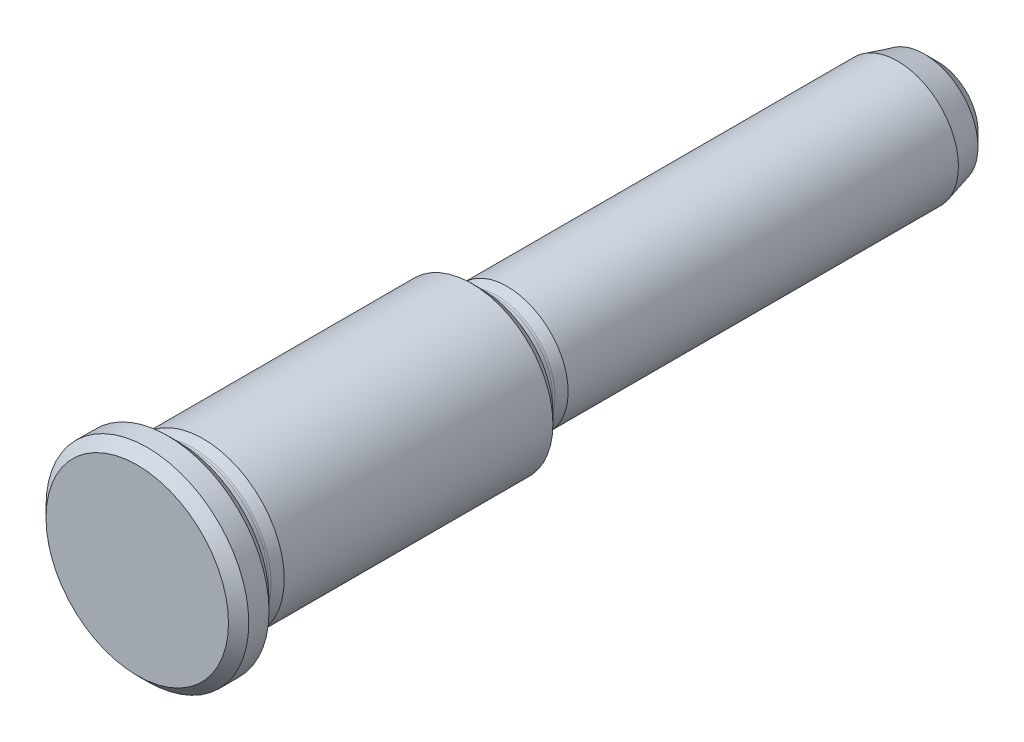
ISO-10303-21;
HEADER;
FILE_DESCRIPTION(('STEP AP214'),'2;1');
FILE_NAME('part.step','',(''),(''),'','','');
FILE_SCHEMA(('AUTOMOTIVE_DESIGN { 1 0 10303 214 1 1 1 1 }'));
ENDSEC;
DATA;
#1=APPLICATION_CONTEXT('core data for automotive mechanical design processes');
#2=APPLICATION_PROTOCOL_DEFINITION('international standard','automotive_design',2000,#1);
#3=PRODUCT_CONTEXT('',#1,'mechanical');
#4=PRODUCT('Part','Part','',(#3));
#5=PRODUCT_RELATED_PRODUCT_CATEGORY('part','',(#4));
#6=PRODUCT_DEFINITION_FORMATION('','',#4);
#7=PRODUCT_DEFINITION_CONTEXT('part definition',#1,'design');
#8=PRODUCT_DEFINITION('design','',#6,#7);
#9=PRODUCT_DEFINITION_SHAPE('','',#8);
#10=(LENGTH_UNIT() NAMED_UNIT(*) SI_UNIT(.MILLI.,.METRE.));
#11=(NAMED_UNIT(*) PLANE_ANGLE_UNIT() SI_UNIT($,.RADIAN.));
#12=(NAMED_UNIT(*) SI_UNIT($,.STERADIAN.) SOLID_ANGLE_UNIT());
#13=UNCERTAINTY_MEASURE_WITH_UNIT(LENGTH_MEASURE(1.E-05),#10,'distance_accuracy_value','');
#14=(GEOMETRIC_REPRESENTATION_CONTEXT(3) GLOBAL_UNCERTAINTY_ASSIGNED_CONTEXT((#13)) GLOBAL_UNIT_ASSIGNED_CONTEXT((#10,
#11,#12)) REPRESENTATION_CONTEXT('',''));
#15=CARTESIAN_POINT('',(0.,0.,0.));
#16=DIRECTION('',(0.,0.,1.));
#17=DIRECTION('',(1.,0.,0.));
#18=AXIS2_PLACEMENT_3D('',#15,#16,#17);
#19=CARTESIAN_POINT('',(0.,0.,0.));
#20=DIRECTION('',(0.,0.,-1.));
#21=DIRECTION('',(-1.,0.,0.));
#22=AXIS2_PLACEMENT_3D('',#19,#20,#21);
#23=PLANE('',#22);
#24=CARTESIAN_POINT('',(0.,0.,0.));
#25=DIRECTION('',(0.,0.,-1.));
#26=DIRECTION('',(-1.,0.,0.));
#27=AXIS2_PLACEMENT_3D('',#24,#25,#26);
#28=CIRCLE('',#27,9.);
#29=CARTESIAN_POINT('',(-9.,0.,0.));
#30=VERTEX_POINT('',#29);
#31=EDGE_CURVE('E9',#30,#30,#28,.F.);
#32=ORIENTED_EDGE('',*,*,#31,.T.);
#33=EDGE_LOOP('',(#32));
#34=FACE_BOUND('',#33,.T.);
#35=ADVANCED_FACE('F14',(#34),#23,.F.);
#36=CARTESIAN_POINT('',(0.,0.,0.));
#37=DIRECTION('',(0.,0.,1.));
#38=DIRECTION('',(1.,0.,0.));
#39=AXIS2_PLACEMENT_3D('',#36,#37,#38);
#40=CYLINDRICAL_SURFACE('',#39,10.);
#41=CARTESIAN_POINT('',(0.,0.,-3.));
#42=DIRECTION('',(0.,0.,1.));
#43=DIRECTION('',(1.,0.,0.));
#44=AXIS2_PLACEMENT_3D('',#41,#42,#43);
#45=CIRCLE('',#44,10.);
#46=CARTESIAN_POINT('',(10.,0.,-3.));
#47=VERTEX_POINT('',#46);
#48=EDGE_CURVE('E25',#47,#47,#45,.T.);
#49=ORIENTED_EDGE('',*,*,#48,.T.);
#50=EDGE_LOOP('',(#49));
#51=FACE_BOUND('',#50,.T.);
#52=CARTESIAN_POINT('',(0.,0.,-0.999999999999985));
#53=DIRECTION('',(0.,0.,-1.));
#54=DIRECTION('',(-1.,0.,0.));
#55=AXIS2_PLACEMENT_3D('',#52,#53,#54);
#56=CIRCLE('',#55,10.);
#57=CARTESIAN_POINT('',(-10.,0.,-0.999999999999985));
#58=VERTEX_POINT('',#57);
#59=EDGE_CURVE('E29',#58,#58,#56,.T.);
#60=ORIENTED_EDGE('',*,*,#59,.T.);
#61=EDGE_LOOP('',(#60));
#62=FACE_BOUND('',#61,.T.);
#63=ADVANCED_FACE('F100',(#51,#62),#40,.T.);
#64=CARTESIAN_POINT('',(0.,10.,-4.));
#65=DIRECTION('',(0.,0.,1.));
#66=DIRECTION('',(1.,0.,0.));
#67=AXIS2_PLACEMENT_3D('',#64,#65,#66);
#68=PLANE('',#67);
#69=CARTESIAN_POINT('',(0.,0.,-4.));
#70=DIRECTION('',(0.,0.,1.));
#71=DIRECTION('',(1.,0.,0.));
#72=AXIS2_PLACEMENT_3D('',#69,#70,#71);
#73=CIRCLE('',#72,9.);
#74=CARTESIAN_POINT('',(9.,0.,-4.));
#75=VERTEX_POINT('',#74);
#76=EDGE_CURVE('E21',#75,#75,#73,.F.);
#77=ORIENTED_EDGE('',*,*,#76,.T.);
#78=EDGE_LOOP('',(#77));
#79=FACE_BOUND('',#78,.T.);
#80=CARTESIAN_POINT('',(0.,0.,-4.));
#81=DIRECTION('',(0.,0.,1.));
#82=DIRECTION('',(1.,0.,0.));
#83=AXIS2_PLACEMENT_3D('',#80,#81,#82);
#84=CIRCLE('',#83,8.5);
#85=CARTESIAN_POINT('',(8.5,0.,-4.));
#86=VERTEX_POINT('',#85);
#87=EDGE_CURVE('E46',#86,#86,#84,.T.);
#88=ORIENTED_EDGE('',*,*,#87,.T.);
#89=EDGE_LOOP('',(#88));
#90=FACE_BOUND('',#89,.T.);
#91=ADVANCED_FACE('F106',(#79,#90),#68,.F.);
#92=CARTESIAN_POINT('',(0.,0.,-4.8));
#93=DIRECTION('',(0.,0.,1.));
#94=DIRECTION('',(1.,0.,0.));
#95=AXIS2_PLACEMENT_3D('',#92,#93,#94);
#96=TOROIDAL_SURFACE('',#95,8.5,0.8);
#97=ORIENTED_EDGE('',*,*,#87,.F.);
#98=EDGE_LOOP('',(#97));
#99=FACE_BOUND('',#98,.T.);
#100=CARTESIAN_POINT('',(0.,0.,-4.8));
#101=DIRECTION('',(0.,0.,1.));
#102=DIRECTION('',(1.,0.,0.));
#103=AXIS2_PLACEMENT_3D('',#100,#101,#102);
#104=CIRCLE('',#103,7.7);
#105=CARTESIAN_POINT('',(7.7,0.,-4.8));
#106=VERTEX_POINT('',#105);
#107=EDGE_CURVE('E49',#106,#106,#104,.T.);
#108=ORIENTED_EDGE('',*,*,#107,.T.);
#109=EDGE_LOOP('',(#108));
#110=FACE_BOUND('',#109,.T.);
#111=ADVANCED_FACE('F176',(#99,#110),#96,.F.);
#112=CARTESIAN_POINT('',(0.,0.,0.));
#113=DIRECTION('',(0.,0.,1.));
#114=DIRECTION('',(1.,0.,0.));
#115=AXIS2_PLACEMENT_3D('',#112,#113,#114);
#116=CYLINDRICAL_SURFACE('',#115,7.7);
#117=ORIENTED_EDGE('',*,*,#107,.F.);
#118=EDGE_LOOP('',(#117));
#119=FACE_BOUND('',#118,.T.);
#120=CARTESIAN_POINT('',(0.,0.,-5.27506275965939));
#121=DIRECTION('',(0.,0.,1.));
#122=DIRECTION('',(1.,0.,0.));
#123=AXIS2_PLACEMENT_3D('',#120,#121,#122);
#124=CIRCLE('',#123,7.7);
#125=CARTESIAN_POINT('',(7.7,0.,-5.27506275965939));
#126=VERTEX_POINT('',#125);
#127=EDGE_CURVE('E52',#126,#126,#124,.T.);
#128=ORIENTED_EDGE('',*,*,#127,.T.);
#129=EDGE_LOOP('',(#128));
#130=FACE_BOUND('',#129,.T.);
#131=ADVANCED_FACE('F232',(#119,#130),#116,.T.);
#132=CARTESIAN_POINT('',(0.,0.,-5.27506275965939));
#133=DIRECTION('',(0.,0.,1.));
#134=DIRECTION('',(1.,0.,0.));
#135=AXIS2_PLACEMENT_3D('',#132,#133,#134);
#136=TOROIDAL_SURFACE('',#135,8.5,0.8);
#137=ORIENTED_EDGE('',*,*,#127,.F.);
#138=EDGE_LOOP('',(#137));
#139=FACE_BOUND('',#138,.T.);
#140=CARTESIAN_POINT('',(0.,0.,-5.4821179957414));
#141=DIRECTION('',(0.,0.,1.));
#142=DIRECTION('',(1.,0.,0.));
#143=AXIS2_PLACEMENT_3D('',#140,#141,#142);
#144=CIRCLE('',#143,7.72725933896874);
#145=CARTESIAN_POINT('',(7.72725933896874,0.,-5.4821179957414));
#146=VERTEX_POINT('',#145);
#147=EDGE_CURVE('E55',#146,#146,#144,.T.);
#148=ORIENTED_EDGE('',*,*,#147,.T.);
#149=EDGE_LOOP('',(#148));
#150=FACE_BOUND('',#149,.T.);
#151=ADVANCED_FACE('F222',(#139,#150),#136,.F.);
#152=CARTESIAN_POINT('',(0.,0.,-6.5));
#153=DIRECTION('',(0.,0.,-1.));
#154=DIRECTION('',(-1.,0.,0.));
#155=AXIS2_PLACEMENT_3D('',#152,#153,#154);
#156=CONICAL_SURFACE('',#155,8.,0.261799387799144);
#157=ORIENTED_EDGE('',*,*,#147,.F.);
#158=EDGE_LOOP('',(#157));
#159=FACE_BOUND('',#158,.T.);
#160=CARTESIAN_POINT('',(0.,0.,-6.5));
#161=DIRECTION('',(0.,0.,1.));
#162=DIRECTION('',(1.,0.,0.));
#163=AXIS2_PLACEMENT_3D('',#160,#161,#162);
#164=CIRCLE('',#163,8.);
#165=CARTESIAN_POINT('',(8.,0.,-6.5));
#166=VERTEX_POINT('',#165);
#167=EDGE_CURVE('E58',#166,#166,#164,.T.);
#168=ORIENTED_EDGE('',*,*,#167,.T.);
#169=EDGE_LOOP('',(#168));
#170=FACE_BOUND('',#169,.T.);
#171=ADVANCED_FACE('F164',(#159,#170),#156,.T.);
#172=CARTESIAN_POINT('',(0.,0.,0.));
#173=DIRECTION('',(0.,0.,1.));
#174=DIRECTION('',(1.,0.,0.));
#175=AXIS2_PLACEMENT_3D('',#172,#173,#174);
#176=CYLINDRICAL_SURFACE('',#175,8.);
#177=CARTESIAN_POINT('',(0.,0.,-33.));
#178=DIRECTION('',(0.,0.,1.));
#179=DIRECTION('',(1.,0.,0.));
#180=AXIS2_PLACEMENT_3D('',#177,#178,#179);
#181=CIRCLE('',#180,8.);
#182=CARTESIAN_POINT('',(8.,0.,-33.));
#183=VERTEX_POINT('',#182);
#184=EDGE_CURVE('E37',#183,#183,#181,.T.);
#185=ORIENTED_EDGE('',*,*,#184,.T.);
#186=EDGE_LOOP('',(#185));
#187=FACE_BOUND('',#186,.T.);
#188=ORIENTED_EDGE('',*,*,#167,.F.);
#189=EDGE_LOOP('',(#188));
#190=FACE_BOUND('',#189,.T.);
#191=ADVANCED_FACE('F152',(#187,#190),#176,.T.);
#192=CARTESIAN_POINT('',(0.,8.,-34.));
#193=DIRECTION('',(0.,0.,1.));
#194=DIRECTION('',(1.,0.,0.));
#195=AXIS2_PLACEMENT_3D('',#192,#193,#194);
#196=PLANE('',#195);
#197=CARTESIAN_POINT('',(0.,0.,-34.));
#198=DIRECTION('',(0.,0.,1.));
#199=DIRECTION('',(1.,0.,0.));
#200=AXIS2_PLACEMENT_3D('',#197,#198,#199);
#201=CIRCLE('',#200,7.);
#202=CARTESIAN_POINT('',(7.,0.,-34.));
#203=VERTEX_POINT('',#202);
#204=EDGE_CURVE('E34',#203,#203,#201,.F.);
#205=ORIENTED_EDGE('',*,*,#204,.T.);
#206=EDGE_LOOP('',(#205));
#207=FACE_BOUND('',#206,.T.);
#208=CARTESIAN_POINT('',(0.,0.,-34.));
#209=DIRECTION('',(0.,0.,1.));
#210=DIRECTION('',(1.,0.,0.));
#211=AXIS2_PLACEMENT_3D('',#208,#209,#210);
#212=CIRCLE('',#211,6.5);
#213=CARTESIAN_POINT('',(6.5,0.,-34.));
#214=VERTEX_POINT('',#213);
#215=EDGE_CURVE('E61',#214,#214,#212,.T.);
#216=ORIENTED_EDGE('',*,*,#215,.T.);
#217=EDGE_LOOP('',(#216));
#218=FACE_BOUND('',#217,.T.);
#219=ADVANCED_FACE('F146',(#207,#218),#196,.F.);
#220=CARTESIAN_POINT('',(0.,0.,-34.8));
#221=DIRECTION('',(0.,0.,1.));
#222=DIRECTION('',(1.,0.,0.));
#223=AXIS2_PLACEMENT_3D('',#220,#221,#222);
#224=TOROIDAL_SURFACE('',#223,6.5,0.8);
#225=ORIENTED_EDGE('',*,*,#215,.F.);
#226=EDGE_LOOP('',(#225));
#227=FACE_BOUND('',#226,.T.);
#228=CARTESIAN_POINT('',(0.,0.,-34.8));
#229=DIRECTION('',(0.,0.,1.));
#230=DIRECTION('',(1.,0.,0.));
#231=AXIS2_PLACEMENT_3D('',#228,#229,#230);
#232=CIRCLE('',#231,5.7);
#233=CARTESIAN_POINT('',(5.7,0.,-34.8));
#234=VERTEX_POINT('',#233);
#235=EDGE_CURVE('E64',#234,#234,#232,.T.);
#236=ORIENTED_EDGE('',*,*,#235,.T.);
#237=EDGE_LOOP('',(#236));
#238=FACE_BOUND('',#237,.T.);
#239=ADVANCED_FACE('F151',(#227,#238),#224,.F.);
#240=CARTESIAN_POINT('',(0.,0.,0.));
#241=DIRECTION('',(0.,0.,1.));
#242=DIRECTION('',(1.,0.,0.));
#243=AXIS2_PLACEMENT_3D('',#240,#241,#242);
#244=CYLINDRICAL_SURFACE('',#243,5.7);
#245=ORIENTED_EDGE('',*,*,#235,.F.);
#246=EDGE_LOOP('',(#245));
#247=FACE_BOUND('',#246,.T.);
#248=CARTESIAN_POINT('',(0.,0.,-35.2750627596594));
#249=DIRECTION('',(0.,0.,1.));
#250=DIRECTION('',(1.,0.,0.));
#251=AXIS2_PLACEMENT_3D('',#248,#249,#250);
#252=CIRCLE('',#251,5.7);
#253=CARTESIAN_POINT('',(5.7,0.,-35.2750627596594));
#254=VERTEX_POINT('',#253);
#255=EDGE_CURVE('E67',#254,#254,#252,.T.);
#256=ORIENTED_EDGE('',*,*,#255,.T.);
#257=EDGE_LOOP('',(#256));
#258=FACE_BOUND('',#257,.T.);
#259=ADVANCED_FACE('F198',(#247,#258),#244,.T.);
#260=CARTESIAN_POINT('',(0.,0.,-35.2750627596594));
#261=DIRECTION('',(0.,0.,1.));
#262=DIRECTION('',(1.,0.,0.));
#263=AXIS2_PLACEMENT_3D('',#260,#261,#262);
#264=TOROIDAL_SURFACE('',#263,6.5,0.8);
#265=ORIENTED_EDGE('',*,*,#255,.F.);
#266=EDGE_LOOP('',(#265));
#267=FACE_BOUND('',#266,.T.);
#268=CARTESIAN_POINT('',(0.,0.,-35.4821179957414));
#269=DIRECTION('',(0.,0.,1.));
#270=DIRECTION('',(1.,0.,0.));
#271=AXIS2_PLACEMENT_3D('',#268,#269,#270);
#272=CIRCLE('',#271,5.72725933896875);
#273=CARTESIAN_POINT('',(5.72725933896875,0.,-35.4821179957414));
#274=VERTEX_POINT('',#273);
#275=EDGE_CURVE('E70',#274,#274,#272,.T.);
#276=ORIENTED_EDGE('',*,*,#275,.T.);
#277=EDGE_LOOP('',(#276));
#278=FACE_BOUND('',#277,.T.);
#279=ADVANCED_FACE('F187',(#267,#278),#264,.F.);
#280=CARTESIAN_POINT('',(0.,0.,-36.5));
#281=DIRECTION('',(0.,0.,-1.));
#282=DIRECTION('',(-1.,0.,0.));
#283=AXIS2_PLACEMENT_3D('',#280,#281,#282);
#284=CONICAL_SURFACE('',#283,6.,0.261799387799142);
#285=ORIENTED_EDGE('',*,*,#275,.F.);
#286=EDGE_LOOP('',(#285));
#287=FACE_BOUND('',#286,.T.);
#288=CARTESIAN_POINT('',(0.,0.,-36.5));
#289=DIRECTION('',(0.,0.,1.));
#290=DIRECTION('',(1.,0.,0.));
#291=AXIS2_PLACEMENT_3D('',#288,#289,#290);
#292=CIRCLE('',#291,6.);
#293=CARTESIAN_POINT('',(6.,0.,-36.5));
#294=VERTEX_POINT('',#293);
#295=EDGE_CURVE('E73',#294,#294,#292,.T.);
#296=ORIENTED_EDGE('',*,*,#295,.T.);
#297=EDGE_LOOP('',(#296));
#298=FACE_BOUND('',#297,.T.);
#299=ADVANCED_FACE('F96',(#287,#298),#284,.T.);
#300=CARTESIAN_POINT('',(0.,0.,0.));
#301=DIRECTION('',(0.,0.,1.));
#302=DIRECTION('',(1.,0.,0.));
#303=AXIS2_PLACEMENT_3D('',#300,#301,#302);
#304=CYLINDRICAL_SURFACE('',#303,6.);
#305=ORIENTED_EDGE('',*,*,#295,.F.);
#306=EDGE_LOOP('',(#305));
#307=FACE_BOUND('',#306,.T.);
#308=CARTESIAN_POINT('',(0.,0.,-75.));
#309=DIRECTION('',(0.,0.,1.));
#310=DIRECTION('',(1.,0.,0.));
#311=AXIS2_PLACEMENT_3D('',#308,#309,#310);
#312=CIRCLE('',#311,6.);
#313=CARTESIAN_POINT('',(6.,0.,-75.));
#314=VERTEX_POINT('',#313);
#315=EDGE_CURVE('E76',#314,#314,#312,.T.);
#316=ORIENTED_EDGE('',*,*,#315,.T.);
#317=EDGE_LOOP('',(#316));
#318=FACE_BOUND('',#317,.T.);
#319=ADVANCED_FACE('F80',(#307,#318),#304,.T.);
#320=CARTESIAN_POINT('',(0.,0.,-79.));
#321=DIRECTION('',(0.,0.,1.));
#322=DIRECTION('',(1.,0.,0.));
#323=AXIS2_PLACEMENT_3D('',#320,#321,#322);
#324=CONICAL_SURFACE('',#323,4.92820323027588,0.261799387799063);
#325=CARTESIAN_POINT('',(0.,0.,-77.6339745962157));
#326=DIRECTION('',(0.,0.,-1.));
#327=DIRECTION('',(-1.,0.,0.));
#328=AXIS2_PLACEMENT_3D('',#325,#326,#327);
#329=CIRCLE('',#328,5.29422863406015);
#330=CARTESIAN_POINT('',(-5.29422863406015,0.,-77.6339745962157));
#331=VERTEX_POINT('',#330);
#332=EDGE_CURVE('E43',#331,#331,#329,.F.);
#333=ORIENTED_EDGE('',*,*,#332,.T.);
#334=EDGE_LOOP('',(#333));
#335=FACE_BOUND('',#334,.T.);
#336=ORIENTED_EDGE('',*,*,#315,.F.);
#337=EDGE_LOOP('',(#336));
#338=FACE_BOUND('',#337,.T.);
#339=ADVANCED_FACE('F82',(#335,#338),#324,.T.);
#340=CARTESIAN_POINT('',(0.,4.92820323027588,-79.));
#341=DIRECTION('',(0.,0.,1.));
#342=DIRECTION('',(1.,0.,0.));
#343=AXIS2_PLACEMENT_3D('',#340,#341,#342);
#344=PLANE('',#343);
#345=CARTESIAN_POINT('',(0.,0.,-79.));
#346=DIRECTION('',(0.,0.,1.));
#347=DIRECTION('',(1.,0.,0.));
#348=AXIS2_PLACEMENT_3D('',#345,#346,#347);
#349=CIRCLE('',#348,3.92820323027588);
#350=CARTESIAN_POINT('',(3.92820323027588,0.,-79.));
#351=VERTEX_POINT('',#350);
#352=EDGE_CURVE('E40',#351,#351,#349,.F.);
#353=ORIENTED_EDGE('',*,*,#352,.T.);
#354=EDGE_LOOP('',(#353));
#355=FACE_BOUND('',#354,.T.);
#356=ADVANCED_FACE('F84',(#355),#344,.F.);
#357=CARTESIAN_POINT('',(0.,0.,-77.6339745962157));
#358=DIRECTION('',(0.,0.,1.));
#359=DIRECTION('',(1.,0.,0.));
#360=AXIS2_PLACEMENT_3D('',#357,#358,#359);
#361=CONICAL_SURFACE('',#360,5.29422863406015,0.785398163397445);
#362=ORIENTED_EDGE('',*,*,#352,.F.);
#363=EDGE_LOOP('',(#362));
#364=FACE_BOUND('',#363,.T.);
#365=ORIENTED_EDGE('',*,*,#332,.F.);
#366=EDGE_LOOP('',(#365));
#367=FACE_BOUND('',#366,.T.);
#368=ADVANCED_FACE('F93',(#364,#367),#361,.T.);
#369=CARTESIAN_POINT('',(0.,0.,-33.));
#370=DIRECTION('',(0.,0.,1.));
#371=DIRECTION('',(1.,0.,0.));
#372=AXIS2_PLACEMENT_3D('',#369,#370,#371);
#373=CONICAL_SURFACE('',#372,8.,0.785398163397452);
#374=ORIENTED_EDGE('',*,*,#204,.F.);
#375=EDGE_LOOP('',(#374));
#376=FACE_BOUND('',#375,.T.);
#377=ORIENTED_EDGE('',*,*,#184,.F.);
#378=EDGE_LOOP('',(#377));
#379=FACE_BOUND('',#378,.T.);
#380=ADVANCED_FACE('F113',(#376,#379),#373,.T.);
#381=CARTESIAN_POINT('',(0.,0.,-3.));
#382=DIRECTION('',(0.,0.,1.));
#383=DIRECTION('',(1.,0.,0.));
#384=AXIS2_PLACEMENT_3D('',#381,#382,#383);
#385=CONICAL_SURFACE('',#384,10.,0.785398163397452);
#386=ORIENTED_EDGE('',*,*,#76,.F.);
#387=EDGE_LOOP('',(#386));
#388=FACE_BOUND('',#387,.T.);
#389=ORIENTED_EDGE('',*,*,#48,.F.);
#390=EDGE_LOOP('',(#389));
#391=FACE_BOUND('',#390,.T.);
#392=ADVANCED_FACE('F116',(#388,#391),#385,.T.);
#393=CARTESIAN_POINT('',(0.,0.,0.));
#394=DIRECTION('',(0.,0.,-1.));
#395=DIRECTION('',(-1.,0.,0.));
#396=AXIS2_PLACEMENT_3D('',#393,#394,#395);
#397=CONICAL_SURFACE('',#396,9.,0.785398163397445);
#398=ORIENTED_EDGE('',*,*,#59,.F.);
#399=EDGE_LOOP('',(#398));
#400=FACE_BOUND('',#399,.T.);
#401=ORIENTED_EDGE('',*,*,#31,.F.);
#402=EDGE_LOOP('',(#401));
#403=FACE_BOUND('',#402,.T.);
#404=ADVANCED_FACE('F16',(#400,#403),#397,.T.);
#405=CLOSED_SHELL('',(#35,#63,#91,#111,#131,#151,#171,#191,#219,#239,#259,#279,#299,#319,#339,
#356,#368,#380,#392,#404));
#406=MANIFOLD_SOLID_BREP('B1',#405);
#407=ADVANCED_BREP_SHAPE_REPRESENTATION('',(#18,#406),#14);
#408=SHAPE_DEFINITION_REPRESENTATION(#9,#407);
ENDSEC;
END-ISO-10303-21;
